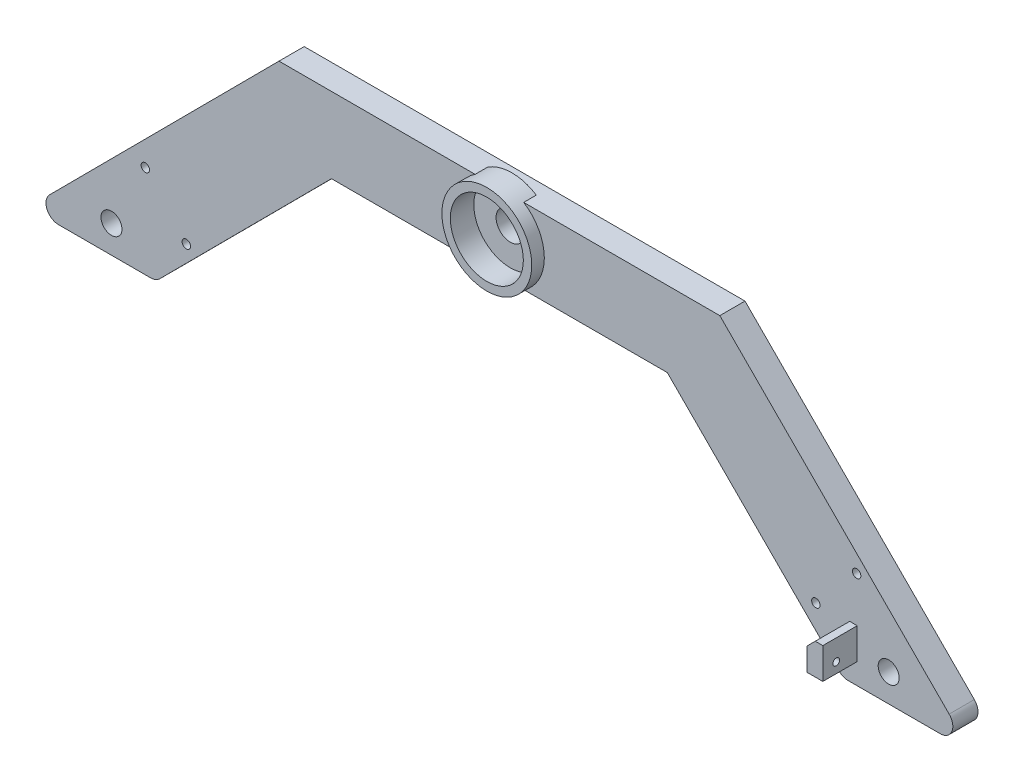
ISO-10303-21;
HEADER;
FILE_DESCRIPTION(('STEP AP214'),'2;1');
FILE_NAME('part.step','',(''),(''),'','','');
FILE_SCHEMA(('AUTOMOTIVE_DESIGN { 1 0 10303 214 1 1 1 1 }'));
ENDSEC;
DATA;
#1=APPLICATION_CONTEXT('core data for automotive mechanical design processes');
#2=APPLICATION_PROTOCOL_DEFINITION('international standard','automotive_design',2000,#1);
#3=PRODUCT_CONTEXT('',#1,'mechanical');
#4=PRODUCT('Part','Part','',(#3));
#5=PRODUCT_RELATED_PRODUCT_CATEGORY('part','',(#4));
#6=PRODUCT_DEFINITION_FORMATION('','',#4);
#7=PRODUCT_DEFINITION_CONTEXT('part definition',#1,'design');
#8=PRODUCT_DEFINITION('design','',#6,#7);
#9=PRODUCT_DEFINITION_SHAPE('','',#8);
#10=(LENGTH_UNIT() NAMED_UNIT(*) SI_UNIT(.MILLI.,.METRE.));
#11=(NAMED_UNIT(*) PLANE_ANGLE_UNIT() SI_UNIT($,.RADIAN.));
#12=(NAMED_UNIT(*) SI_UNIT($,.STERADIAN.) SOLID_ANGLE_UNIT());
#13=UNCERTAINTY_MEASURE_WITH_UNIT(LENGTH_MEASURE(1.E-05),#10,'distance_accuracy_value','');
#14=(GEOMETRIC_REPRESENTATION_CONTEXT(3) GLOBAL_UNCERTAINTY_ASSIGNED_CONTEXT((#13)) GLOBAL_UNIT_ASSIGNED_CONTEXT((#10,
#11,#12)) REPRESENTATION_CONTEXT('',''));
#15=CARTESIAN_POINT('',(0.,0.,0.));
#16=DIRECTION('',(0.,0.,1.));
#17=DIRECTION('',(1.,0.,0.));
#18=AXIS2_PLACEMENT_3D('',#15,#16,#17);
#19=CARTESIAN_POINT('',(-47.8356723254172,-72.890134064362,3.81));
#20=DIRECTION('',(0.,0.,-1.));
#21=DIRECTION('',(-1.,0.,0.));
#22=AXIS2_PLACEMENT_3D('',#19,#20,#21);
#23=PLANE('',#22);
#24=CARTESIAN_POINT('',(153.351887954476,-61.252783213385,3.81));
#25=DIRECTION('',(0.,0.,-1.));
#26=DIRECTION('',(-1.,0.,0.));
#27=AXIS2_PLACEMENT_3D('',#24,#25,#26);
#28=CIRCLE('',#27,1.27);
#29=CARTESIAN_POINT('',(152.081887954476,-61.252783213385,3.81));
#30=VERTEX_POINT('',#29);
#31=EDGE_CURVE('E488',#30,#30,#28,.T.);
#32=ORIENTED_EDGE('',*,*,#31,.T.);
#33=EDGE_LOOP('',(#32));
#34=FACE_BOUND('',#33,.T.);
#35=CARTESIAN_POINT('',(165.69439712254,-47.3692411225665,3.81));
#36=DIRECTION('',(0.,0.,-1.));
#37=DIRECTION('',(-1.,0.,0.));
#38=AXIS2_PLACEMENT_3D('',#35,#36,#37);
#39=CIRCLE('',#38,1.27);
#40=CARTESIAN_POINT('',(164.42439712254,-47.3692411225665,3.81));
#41=VERTEX_POINT('',#40);
#42=EDGE_CURVE('E485',#41,#41,#39,.T.);
#43=ORIENTED_EDGE('',*,*,#42,.T.);
#44=EDGE_LOOP('',(#43));
#45=FACE_BOUND('',#44,.T.);
#46=CARTESIAN_POINT('',(175.383820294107,-68.318134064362,3.81));
#47=DIRECTION('',(0.,0.,1.));
#48=DIRECTION('',(1.,0.,0.));
#49=AXIS2_PLACEMENT_3D('',#46,#47,#48);
#50=CIRCLE('',#49,3.175);
#51=CARTESIAN_POINT('',(178.558820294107,-68.318134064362,3.81));
#52=VERTEX_POINT('',#51);
#53=EDGE_CURVE('E253',#52,#52,#50,.T.);
#54=ORIENTED_EDGE('',*,*,#53,.F.);
#55=EDGE_LOOP('',(#54));
#56=FACE_BOUND('',#55,.T.);
#57=CARTESIAN_POINT('',(57.6277046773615,-11.930134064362,3.81));
#58=DIRECTION('',(0.,0.,-1.));
#59=DIRECTION('',(-1.,0.,0.));
#60=AXIS2_PLACEMENT_3D('',#57,#58,#59);
#61=CIRCLE('',#60,13.589);
#62=CARTESIAN_POINT('',(64.9627208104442,-23.3694723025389,3.81));
#63=VERTEX_POINT('',#62);
#64=CARTESIAN_POINT('',(64.9772639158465,-0.500134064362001,3.81));
#65=VERTEX_POINT('',#64);
#66=EDGE_CURVE('E354',#63,#65,#61,.F.);
#67=ORIENTED_EDGE('',*,*,#66,.F.);
#68=DIRECTION('',(1.,0.,0.));
#69=VECTOR('',#68,1.);
#70=CARTESIAN_POINT('',(6.82770467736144,-23.3694723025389,3.81));
#71=LINE('',#70,#69);
#72=CARTESIAN_POINT('',(108.427704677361,-23.3694723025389,3.81));
#73=VERTEX_POINT('',#72);
#74=EDGE_CURVE('E290',#63,#73,#71,.T.);
#75=ORIENTED_EDGE('',*,*,#74,.T.);
#76=DIRECTION('',(-0.7054389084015,0.708770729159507,0.));
#77=VECTOR('',#76,1.);
#78=CARTESIAN_POINT('',(160.390665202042,-75.5778563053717,3.81));
#79=LINE('',#78,#77);
#80=CARTESIAN_POINT('',(160.390665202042,-75.5778563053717,3.81));
#81=VERTEX_POINT('',#80);
#82=EDGE_CURVE('E287',#81,#73,#79,.T.);
#83=ORIENTED_EDGE('',*,*,#82,.F.);
#84=CARTESIAN_POINT('',(163.09108168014,-72.890134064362,3.81));
#85=DIRECTION('',(0.,0.,1.));
#86=DIRECTION('',(1.,0.,0.));
#87=AXIS2_PLACEMENT_3D('',#84,#85,#86);
#88=CIRCLE('',#87,3.81000000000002);
#89=CARTESIAN_POINT('',(163.09108168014,-76.700134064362,3.81));
#90=VERTEX_POINT('',#89);
#91=EDGE_CURVE('E285',#81,#90,#88,.T.);
#92=ORIENTED_EDGE('',*,*,#91,.T.);
#93=DIRECTION('',(-1.,0.,0.));
#94=VECTOR('',#93,1.);
#95=CARTESIAN_POINT('',(190.977704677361,-76.700134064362,3.81));
#96=LINE('',#95,#94);
#97=CARTESIAN_POINT('',(190.977704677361,-76.700134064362,3.81));
#98=VERTEX_POINT('',#97);
#99=EDGE_CURVE('E282',#98,#90,#96,.T.);
#100=ORIENTED_EDGE('',*,*,#99,.F.);
#101=CARTESIAN_POINT('',(190.977704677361,-72.890134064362,3.81));
#102=DIRECTION('',(0.,0.,1.));
#103=DIRECTION('',(1.,0.,0.));
#104=AXIS2_PLACEMENT_3D('',#101,#102,#103);
#105=CIRCLE('',#104,3.81000000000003);
#106=CARTESIAN_POINT('',(193.678121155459,-70.2024118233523,3.81));
#107=VERTEX_POINT('',#106);
#108=EDGE_CURVE('E280',#98,#107,#105,.T.);
#109=ORIENTED_EDGE('',*,*,#108,.T.);
#110=DIRECTION('',(-0.705438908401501,0.708770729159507,0.));
#111=VECTOR('',#110,1.);
#112=CARTESIAN_POINT('',(193.678121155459,-70.2024118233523,3.81));
#113=LINE('',#112,#111);
#114=CARTESIAN_POINT('',(124.303502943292,-0.500134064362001,3.81));
#115=VERTEX_POINT('',#114);
#116=EDGE_CURVE('E277',#107,#115,#113,.T.);
#117=ORIENTED_EDGE('',*,*,#116,.T.);
#118=DIRECTION('',(1.,0.,0.));
#119=VECTOR('',#118,1.);
#120=CARTESIAN_POINT('',(-9.04809358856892,-0.500134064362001,3.81));
#121=LINE('',#120,#119);
#122=EDGE_CURVE('E273',#65,#115,#121,.T.);
#123=ORIENTED_EDGE('',*,*,#122,.F.);
#124=EDGE_LOOP('',(#67,#75,#83,#92,#100,#109,#117,#123));
#125=FACE_BOUND('',#124,.T.);
#126=DIRECTION('',(0.,-1.,0.));
#127=VECTOR('',#126,1.);
#128=CARTESIAN_POINT('',(161.049297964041,-60.952134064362,3.81));
#129=LINE('',#128,#127);
#130=CARTESIAN_POINT('',(161.049297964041,-63.492134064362,3.81));
#131=VERTEX_POINT('',#130);
#132=CARTESIAN_POINT('',(161.049297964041,-70.350134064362,3.81));
#133=VERTEX_POINT('',#132);
#134=EDGE_CURVE('E208',#131,#133,#129,.T.);
#135=ORIENTED_EDGE('',*,*,#134,.F.);
#136=DIRECTION('',(-0.707106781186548,-0.707106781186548,0.));
#137=VECTOR('',#136,1.);
#138=CARTESIAN_POINT('',(51.9078128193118,-172.633619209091,3.81));
#139=LINE('',#138,#137);
#140=CARTESIAN_POINT('',(163.589297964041,-60.952134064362,3.81));
#141=VERTEX_POINT('',#140);
#142=EDGE_CURVE('E64',#131,#141,#139,.F.);
#143=ORIENTED_EDGE('',*,*,#142,.T.);
#144=DIRECTION('',(-1.,0.,0.));
#145=VECTOR('',#144,1.);
#146=CARTESIAN_POINT('',(161.049297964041,-60.952134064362,3.81));
#147=LINE('',#146,#145);
#148=CARTESIAN_POINT('',(165.875297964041,-60.952134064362,3.81));
#149=VERTEX_POINT('',#148);
#150=EDGE_CURVE('E195',#149,#141,#147,.T.);
#151=ORIENTED_EDGE('',*,*,#150,.F.);
#152=DIRECTION('',(0.,1.,0.));
#153=VECTOR('',#152,1.);
#154=CARTESIAN_POINT('',(165.875297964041,-60.952134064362,3.81));
#155=LINE('',#154,#153);
#156=CARTESIAN_POINT('',(165.875297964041,-70.350134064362,3.81));
#157=VERTEX_POINT('',#156);
#158=EDGE_CURVE('E504',#157,#149,#155,.T.);
#159=ORIENTED_EDGE('',*,*,#158,.F.);
#160=DIRECTION('',(1.,0.,0.));
#161=VECTOR('',#160,1.);
#162=CARTESIAN_POINT('',(161.049297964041,-70.350134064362,3.81));
#163=LINE('',#162,#161);
#164=EDGE_CURVE('E502',#133,#157,#163,.T.);
#165=ORIENTED_EDGE('',*,*,#164,.F.);
#166=EDGE_LOOP('',(#135,#143,#151,#159,#165));
#167=FACE_BOUND('',#166,.T.);
#168=ADVANCED_FACE('F41',(#34,#45,#56,#125,#167),#23,.F.);
#169=CARTESIAN_POINT('',(57.6277046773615,-11.930134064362,-16.0231483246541));
#170=DIRECTION('',(0.,0.,1.));
#171=DIRECTION('',(1.,0.,0.));
#172=AXIS2_PLACEMENT_3D('',#169,#170,#171);
#173=CYLINDRICAL_SURFACE('',#172,4.318);
#174=CARTESIAN_POINT('',(57.6277046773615,-11.930134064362,-3.81));
#175=DIRECTION('',(0.,0.,-1.));
#176=DIRECTION('',(-1.,0.,0.));
#177=AXIS2_PLACEMENT_3D('',#174,#175,#176);
#178=CIRCLE('',#177,4.318);
#179=CARTESIAN_POINT('',(53.3097046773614,-11.930134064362,-3.81));
#180=VERTEX_POINT('',#179);
#181=EDGE_CURVE('E222',#180,#180,#178,.F.);
#182=ORIENTED_EDGE('',*,*,#181,.F.);
#183=EDGE_LOOP('',(#182));
#184=FACE_BOUND('',#183,.T.);
#185=CARTESIAN_POINT('',(57.6277046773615,-11.930134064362,0.507999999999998));
#186=DIRECTION('',(0.,0.,1.));
#187=DIRECTION('',(1.,0.,0.));
#188=AXIS2_PLACEMENT_3D('',#185,#186,#187);
#189=CIRCLE('',#188,4.318);
#190=CARTESIAN_POINT('',(61.9457046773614,-11.930134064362,0.507999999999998));
#191=VERTEX_POINT('',#190);
#192=EDGE_CURVE('E220',#191,#191,#189,.F.);
#193=ORIENTED_EDGE('',*,*,#192,.F.);
#194=EDGE_LOOP('',(#193));
#195=FACE_BOUND('',#194,.T.);
#196=ADVANCED_FACE('F383',(#184,#195),#173,.F.);
#197=CARTESIAN_POINT('',(6.82770467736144,-23.3694723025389,3.81));
#198=DIRECTION('',(0.,1.,0.));
#199=DIRECTION('',(0.,0.,1.));
#200=AXIS2_PLACEMENT_3D('',#197,#198,#199);
#201=PLANE('',#200);
#202=DIRECTION('',(0.,0.,-1.));
#203=VECTOR('',#202,1.);
#204=CARTESIAN_POINT('',(64.9627208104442,-23.3694723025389,7.62));
#205=LINE('',#204,#203);
#206=CARTESIAN_POINT('',(64.9627208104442,-23.3694723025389,0.));
#207=VERTEX_POINT('',#206);
#208=EDGE_CURVE('E239',#207,#63,#205,.F.);
#209=ORIENTED_EDGE('',*,*,#208,.F.);
#210=DIRECTION('',(1.,0.,0.));
#211=VECTOR('',#210,1.);
#212=CARTESIAN_POINT('',(6.82770467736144,-23.3694723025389,0.));
#213=LINE('',#212,#211);
#214=CARTESIAN_POINT('',(50.2926885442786,-23.3694723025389,0.));
#215=VERTEX_POINT('',#214);
#216=EDGE_CURVE('E242',#215,#207,#213,.T.);
#217=ORIENTED_EDGE('',*,*,#216,.F.);
#218=DIRECTION('',(0.,0.,-1.));
#219=VECTOR('',#218,1.);
#220=CARTESIAN_POINT('',(50.2926885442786,-23.3694723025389,7.62));
#221=LINE('',#220,#219);
#222=CARTESIAN_POINT('',(50.2926885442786,-23.3694723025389,3.81));
#223=VERTEX_POINT('',#222);
#224=EDGE_CURVE('E234',#223,#215,#221,.T.);
#225=ORIENTED_EDGE('',*,*,#224,.F.);
#226=CARTESIAN_POINT('',(6.82770467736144,-23.3694723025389,3.81));
#227=VERTEX_POINT('',#226);
#228=EDGE_CURVE('E291',#227,#223,#71,.T.);
#229=ORIENTED_EDGE('',*,*,#228,.F.);
#230=DIRECTION('',(0.,0.,-1.));
#231=VECTOR('',#230,1.);
#232=CARTESIAN_POINT('',(6.82770467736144,-23.3694723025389,3.81));
#233=LINE('',#232,#231);
#234=CARTESIAN_POINT('',(6.82770467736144,-23.3694723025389,-3.81));
#235=VERTEX_POINT('',#234);
#236=EDGE_CURVE('E327',#227,#235,#233,.T.);
#237=ORIENTED_EDGE('',*,*,#236,.T.);
#238=DIRECTION('',(1.,0.,0.));
#239=VECTOR('',#238,1.);
#240=CARTESIAN_POINT('',(6.82770467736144,-23.3694723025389,-3.81));
#241=LINE('',#240,#239);
#242=CARTESIAN_POINT('',(108.427704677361,-23.3694723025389,-3.81));
#243=VERTEX_POINT('',#242);
#244=EDGE_CURVE('E262',#235,#243,#241,.T.);
#245=ORIENTED_EDGE('',*,*,#244,.T.);
#246=DIRECTION('',(0.,0.,-1.));
#247=VECTOR('',#246,1.);
#248=CARTESIAN_POINT('',(108.427704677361,-23.3694723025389,3.81));
#249=LINE('',#248,#247);
#250=EDGE_CURVE('E330',#73,#243,#249,.T.);
#251=ORIENTED_EDGE('',*,*,#250,.F.);
#252=ORIENTED_EDGE('',*,*,#74,.F.);
#253=EDGE_LOOP('',(#209,#217,#225,#229,#237,#245,#251,#252));
#254=FACE_BOUND('',#253,.T.);
#255=ADVANCED_FACE('F391',(#254),#201,.F.);
#256=CARTESIAN_POINT('',(-9.04809358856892,-0.500134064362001,3.81));
#257=DIRECTION('',(0.,1.,0.));
#258=DIRECTION('',(0.,0.,1.));
#259=AXIS2_PLACEMENT_3D('',#256,#257,#258);
#260=PLANE('',#259);
#261=DIRECTION('',(1.,0.,0.));
#262=VECTOR('',#261,1.);
#263=CARTESIAN_POINT('',(-9.04809358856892,-0.500134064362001,0.));
#264=LINE('',#263,#262);
#265=CARTESIAN_POINT('',(50.2781454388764,-0.500134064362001,0.));
#266=VERTEX_POINT('',#265);
#267=CARTESIAN_POINT('',(64.9772639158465,-0.500134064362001,0.));
#268=VERTEX_POINT('',#267);
#269=EDGE_CURVE('E355',#266,#268,#264,.T.);
#270=ORIENTED_EDGE('',*,*,#269,.T.);
#271=DIRECTION('',(0.,0.,-1.));
#272=VECTOR('',#271,1.);
#273=CARTESIAN_POINT('',(64.9772639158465,-0.500134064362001,7.62));
#274=LINE('',#273,#272);
#275=EDGE_CURVE('E237',#268,#65,#274,.F.);
#276=ORIENTED_EDGE('',*,*,#275,.T.);
#277=ORIENTED_EDGE('',*,*,#122,.T.);
#278=DIRECTION('',(0.,0.,-1.));
#279=VECTOR('',#278,1.);
#280=CARTESIAN_POINT('',(124.303502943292,-0.500134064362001,3.81));
#281=LINE('',#280,#279);
#282=CARTESIAN_POINT('',(124.303502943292,-0.500134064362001,-3.81));
#283=VERTEX_POINT('',#282);
#284=EDGE_CURVE('E341',#115,#283,#281,.T.);
#285=ORIENTED_EDGE('',*,*,#284,.T.);
#286=DIRECTION('',(1.,0.,0.));
#287=VECTOR('',#286,1.);
#288=CARTESIAN_POINT('',(-9.04809358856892,-0.500134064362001,-3.81));
#289=LINE('',#288,#287);
#290=CARTESIAN_POINT('',(-9.04809358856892,-0.500134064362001,-3.81));
#291=VERTEX_POINT('',#290);
#292=EDGE_CURVE('E308',#291,#283,#289,.T.);
#293=ORIENTED_EDGE('',*,*,#292,.F.);
#294=DIRECTION('',(0.,0.,-1.));
#295=VECTOR('',#294,1.);
#296=CARTESIAN_POINT('',(-9.04809358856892,-0.500134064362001,3.81));
#297=LINE('',#296,#295);
#298=CARTESIAN_POINT('',(-9.04809358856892,-0.500134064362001,3.81));
#299=VERTEX_POINT('',#298);
#300=EDGE_CURVE('E343',#299,#291,#297,.T.);
#301=ORIENTED_EDGE('',*,*,#300,.F.);
#302=CARTESIAN_POINT('',(50.2781454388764,-0.500134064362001,3.81));
#303=VERTEX_POINT('',#302);
#304=EDGE_CURVE('E274',#299,#303,#121,.T.);
#305=ORIENTED_EDGE('',*,*,#304,.T.);
#306=DIRECTION('',(0.,0.,-1.));
#307=VECTOR('',#306,1.);
#308=CARTESIAN_POINT('',(50.2781454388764,-0.500134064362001,7.62));
#309=LINE('',#308,#307);
#310=EDGE_CURVE('E229',#303,#266,#309,.T.);
#311=ORIENTED_EDGE('',*,*,#310,.T.);
#312=EDGE_LOOP('',(#270,#276,#277,#285,#293,#301,#305,#311));
#313=FACE_BOUND('',#312,.T.);
#314=ADVANCED_FACE('F521',(#313),#260,.T.);
#315=CARTESIAN_POINT('',(6.82770467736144,-23.3694723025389,3.81));
#316=DIRECTION('',(0.708770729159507,-0.7054389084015,0.));
#317=DIRECTION('',(0.7054389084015,0.708770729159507,0.));
#318=AXIS2_PLACEMENT_3D('',#315,#316,#317);
#319=PLANE('',#318);
#320=DIRECTION('',(-0.7054389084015,-0.708770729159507,0.));
#321=VECTOR('',#320,1.);
#322=CARTESIAN_POINT('',(6.82770467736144,-23.3694723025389,-3.81));
#323=LINE('',#322,#321);
#324=CARTESIAN_POINT('',(-45.1352558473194,-75.5778563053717,-3.81));
#325=VERTEX_POINT('',#324);
#326=EDGE_CURVE('E249',#235,#325,#323,.T.);
#327=ORIENTED_EDGE('',*,*,#326,.F.);
#328=ORIENTED_EDGE('',*,*,#236,.F.);
#329=DIRECTION('',(-0.7054389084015,-0.708770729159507,0.));
#330=VECTOR('',#329,1.);
#331=CARTESIAN_POINT('',(6.82770467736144,-23.3694723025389,3.81));
#332=LINE('',#331,#330);
#333=CARTESIAN_POINT('',(-45.1352558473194,-75.5778563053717,3.81));
#334=VERTEX_POINT('',#333);
#335=EDGE_CURVE('E258',#227,#334,#332,.T.);
#336=ORIENTED_EDGE('',*,*,#335,.T.);
#337=DIRECTION('',(0.,0.,-1.));
#338=VECTOR('',#337,1.);
#339=CARTESIAN_POINT('',(-45.1352558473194,-75.5778563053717,3.81));
#340=LINE('',#339,#338);
#341=EDGE_CURVE('E293',#334,#325,#340,.T.);
#342=ORIENTED_EDGE('',*,*,#341,.T.);
#343=EDGE_LOOP('',(#327,#328,#336,#342));
#344=FACE_BOUND('',#343,.T.);
#345=ADVANCED_FACE('F518',(#344),#319,.T.);
#346=CARTESIAN_POINT('',(160.390665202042,-75.5778563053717,3.81));
#347=DIRECTION('',(-0.708770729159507,-0.7054389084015,0.));
#348=DIRECTION('',(0.7054389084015,-0.708770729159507,0.));
#349=AXIS2_PLACEMENT_3D('',#346,#347,#348);
#350=PLANE('',#349);
#351=DIRECTION('',(-0.7054389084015,0.708770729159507,0.));
#352=VECTOR('',#351,1.);
#353=CARTESIAN_POINT('',(160.390665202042,-75.5778563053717,-3.81));
#354=LINE('',#353,#352);
#355=CARTESIAN_POINT('',(160.390665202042,-75.5778563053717,-3.81));
#356=VERTEX_POINT('',#355);
#357=EDGE_CURVE('E322',#356,#243,#354,.T.);
#358=ORIENTED_EDGE('',*,*,#357,.F.);
#359=DIRECTION('',(0.,0.,-1.));
#360=VECTOR('',#359,1.);
#361=CARTESIAN_POINT('',(160.390665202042,-75.5778563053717,3.81));
#362=LINE('',#361,#360);
#363=EDGE_CURVE('E332',#81,#356,#362,.T.);
#364=ORIENTED_EDGE('',*,*,#363,.F.);
#365=ORIENTED_EDGE('',*,*,#82,.T.);
#366=ORIENTED_EDGE('',*,*,#250,.T.);
#367=EDGE_LOOP('',(#358,#364,#365,#366));
#368=FACE_BOUND('',#367,.T.);
#369=ADVANCED_FACE('F520',(#368),#350,.T.);
#370=CARTESIAN_POINT('',(163.09108168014,-72.890134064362,3.81));
#371=DIRECTION('',(0.,0.,-1.));
#372=DIRECTION('',(-1.,0.,0.));
#373=AXIS2_PLACEMENT_3D('',#370,#371,#372);
#374=CYLINDRICAL_SURFACE('',#373,3.81000000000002);
#375=CARTESIAN_POINT('',(163.09108168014,-72.890134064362,-3.81));
#376=DIRECTION('',(0.,0.,1.));
#377=DIRECTION('',(1.,0.,0.));
#378=AXIS2_PLACEMENT_3D('',#375,#376,#377);
#379=CIRCLE('',#378,3.81000000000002);
#380=CARTESIAN_POINT('',(163.09108168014,-76.700134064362,-3.81));
#381=VERTEX_POINT('',#380);
#382=EDGE_CURVE('E319',#356,#381,#379,.T.);
#383=ORIENTED_EDGE('',*,*,#382,.T.);
#384=DIRECTION('',(0.,0.,-1.));
#385=VECTOR('',#384,1.);
#386=CARTESIAN_POINT('',(163.09108168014,-76.700134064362,3.81));
#387=LINE('',#386,#385);
#388=EDGE_CURVE('E334',#90,#381,#387,.T.);
#389=ORIENTED_EDGE('',*,*,#388,.F.);
#390=ORIENTED_EDGE('',*,*,#91,.F.);
#391=ORIENTED_EDGE('',*,*,#363,.T.);
#392=EDGE_LOOP('',(#383,#389,#390,#391));
#393=FACE_BOUND('',#392,.T.);
#394=ADVANCED_FACE('F549',(#393),#374,.T.);
#395=CARTESIAN_POINT('',(190.977704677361,-76.700134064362,3.81));
#396=DIRECTION('',(0.,-1.,0.));
#397=DIRECTION('',(1.,0.,0.));
#398=AXIS2_PLACEMENT_3D('',#395,#396,#397);
#399=PLANE('',#398);
#400=DIRECTION('',(-1.,0.,0.));
#401=VECTOR('',#400,1.);
#402=CARTESIAN_POINT('',(190.977704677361,-76.700134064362,-3.81));
#403=LINE('',#402,#401);
#404=CARTESIAN_POINT('',(190.977704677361,-76.700134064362,-3.81));
#405=VERTEX_POINT('',#404);
#406=EDGE_CURVE('E316',#405,#381,#403,.T.);
#407=ORIENTED_EDGE('',*,*,#406,.F.);
#408=DIRECTION('',(0.,0.,-1.));
#409=VECTOR('',#408,1.);
#410=CARTESIAN_POINT('',(190.977704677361,-76.700134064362,3.81));
#411=LINE('',#410,#409);
#412=EDGE_CURVE('E336',#98,#405,#411,.T.);
#413=ORIENTED_EDGE('',*,*,#412,.F.);
#414=ORIENTED_EDGE('',*,*,#99,.T.);
#415=ORIENTED_EDGE('',*,*,#388,.T.);
#416=EDGE_LOOP('',(#407,#413,#414,#415));
#417=FACE_BOUND('',#416,.T.);
#418=ADVANCED_FACE('F545',(#417),#399,.T.);
#419=CARTESIAN_POINT('',(190.977704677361,-72.890134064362,3.81));
#420=DIRECTION('',(0.,0.,-1.));
#421=DIRECTION('',(-1.,0.,0.));
#422=AXIS2_PLACEMENT_3D('',#419,#420,#421);
#423=CYLINDRICAL_SURFACE('',#422,3.81000000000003);
#424=CARTESIAN_POINT('',(190.977704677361,-72.890134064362,-3.81));
#425=DIRECTION('',(0.,0.,1.));
#426=DIRECTION('',(1.,0.,0.));
#427=AXIS2_PLACEMENT_3D('',#424,#425,#426);
#428=CIRCLE('',#427,3.81000000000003);
#429=CARTESIAN_POINT('',(193.678121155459,-70.2024118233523,-3.81));
#430=VERTEX_POINT('',#429);
#431=EDGE_CURVE('E314',#405,#430,#428,.T.);
#432=ORIENTED_EDGE('',*,*,#431,.T.);
#433=DIRECTION('',(0.,0.,-1.));
#434=VECTOR('',#433,1.);
#435=CARTESIAN_POINT('',(193.678121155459,-70.2024118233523,3.81));
#436=LINE('',#435,#434);
#437=EDGE_CURVE('E338',#107,#430,#436,.T.);
#438=ORIENTED_EDGE('',*,*,#437,.F.);
#439=ORIENTED_EDGE('',*,*,#108,.F.);
#440=ORIENTED_EDGE('',*,*,#412,.T.);
#441=EDGE_LOOP('',(#432,#438,#439,#440));
#442=FACE_BOUND('',#441,.T.);
#443=ADVANCED_FACE('F541',(#442),#423,.T.);
#444=CARTESIAN_POINT('',(193.678121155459,-70.2024118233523,3.81));
#445=DIRECTION('',(-0.708770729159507,-0.7054389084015,0.));
#446=DIRECTION('',(0.7054389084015,-0.708770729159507,0.));
#447=AXIS2_PLACEMENT_3D('',#444,#445,#446);
#448=PLANE('',#447);
#449=DIRECTION('',(-0.705438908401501,0.708770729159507,0.));
#450=VECTOR('',#449,1.);
#451=CARTESIAN_POINT('',(193.678121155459,-70.2024118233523,-3.81));
#452=LINE('',#451,#450);
#453=EDGE_CURVE('E311',#430,#283,#452,.T.);
#454=ORIENTED_EDGE('',*,*,#453,.T.);
#455=ORIENTED_EDGE('',*,*,#284,.F.);
#456=ORIENTED_EDGE('',*,*,#116,.F.);
#457=ORIENTED_EDGE('',*,*,#437,.T.);
#458=EDGE_LOOP('',(#454,#455,#456,#457));
#459=FACE_BOUND('',#458,.T.);
#460=ADVANCED_FACE('F534',(#459),#448,.F.);
#461=CARTESIAN_POINT('',(-78.4227118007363,-70.2024118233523,3.81));
#462=DIRECTION('',(-0.708770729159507,0.7054389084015,0.));
#463=DIRECTION('',(-0.7054389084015,-0.708770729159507,0.));
#464=AXIS2_PLACEMENT_3D('',#461,#462,#463);
#465=PLANE('',#464);
#466=DIRECTION('',(0.7054389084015,0.708770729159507,0.));
#467=VECTOR('',#466,1.);
#468=CARTESIAN_POINT('',(-78.4227118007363,-70.2024118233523,-3.81));
#469=LINE('',#468,#467);
#470=CARTESIAN_POINT('',(-78.4227118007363,-70.2024118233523,-3.81));
#471=VERTEX_POINT('',#470);
#472=EDGE_CURVE('E305',#471,#291,#469,.T.);
#473=ORIENTED_EDGE('',*,*,#472,.F.);
#474=DIRECTION('',(0.,0.,-1.));
#475=VECTOR('',#474,1.);
#476=CARTESIAN_POINT('',(-78.4227118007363,-70.2024118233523,3.81));
#477=LINE('',#476,#475);
#478=CARTESIAN_POINT('',(-78.4227118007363,-70.2024118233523,3.81));
#479=VERTEX_POINT('',#478);
#480=EDGE_CURVE('E345',#479,#471,#477,.T.);
#481=ORIENTED_EDGE('',*,*,#480,.F.);
#482=DIRECTION('',(0.7054389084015,0.708770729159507,0.));
#483=VECTOR('',#482,1.);
#484=CARTESIAN_POINT('',(-78.4227118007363,-70.2024118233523,3.81));
#485=LINE('',#484,#483);
#486=EDGE_CURVE('E270',#479,#299,#485,.T.);
#487=ORIENTED_EDGE('',*,*,#486,.T.);
#488=ORIENTED_EDGE('',*,*,#300,.T.);
#489=EDGE_LOOP('',(#473,#481,#487,#488));
#490=FACE_BOUND('',#489,.T.);
#491=ADVANCED_FACE('F530',(#490),#465,.T.);
#492=CARTESIAN_POINT('',(-75.7222953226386,-72.890134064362,3.81));
#493=DIRECTION('',(0.,0.,-1.));
#494=DIRECTION('',(-1.,0.,0.));
#495=AXIS2_PLACEMENT_3D('',#492,#493,#494);
#496=CYLINDRICAL_SURFACE('',#495,3.80999999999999);
#497=CARTESIAN_POINT('',(-75.7222953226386,-72.890134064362,-3.81));
#498=DIRECTION('',(0.,0.,-1.));
#499=DIRECTION('',(-1.,0.,0.));
#500=AXIS2_PLACEMENT_3D('',#497,#498,#499);
#501=CIRCLE('',#500,3.80999999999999);
#502=CARTESIAN_POINT('',(-75.7222953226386,-76.700134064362,-3.81));
#503=VERTEX_POINT('',#502);
#504=EDGE_CURVE('E302',#503,#471,#501,.T.);
#505=ORIENTED_EDGE('',*,*,#504,.F.);
#506=DIRECTION('',(0.,0.,-1.));
#507=VECTOR('',#506,1.);
#508=CARTESIAN_POINT('',(-75.7222953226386,-76.700134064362,3.81));
#509=LINE('',#508,#507);
#510=CARTESIAN_POINT('',(-75.7222953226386,-76.700134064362,3.81));
#511=VERTEX_POINT('',#510);
#512=EDGE_CURVE('E347',#511,#503,#509,.T.);
#513=ORIENTED_EDGE('',*,*,#512,.F.);
#514=CARTESIAN_POINT('',(-75.7222953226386,-72.890134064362,3.81));
#515=DIRECTION('',(0.,0.,-1.));
#516=DIRECTION('',(-1.,0.,0.));
#517=AXIS2_PLACEMENT_3D('',#514,#515,#516);
#518=CIRCLE('',#517,3.80999999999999);
#519=EDGE_CURVE('E267',#511,#479,#518,.T.);
#520=ORIENTED_EDGE('',*,*,#519,.T.);
#521=ORIENTED_EDGE('',*,*,#480,.T.);
#522=EDGE_LOOP('',(#505,#513,#520,#521));
#523=FACE_BOUND('',#522,.T.);
#524=ADVANCED_FACE('F526',(#523),#496,.T.);
#525=CARTESIAN_POINT('',(-75.7222953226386,-76.700134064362,3.81));
#526=DIRECTION('',(0.,1.,0.));
#527=DIRECTION('',(-1.,0.,0.));
#528=AXIS2_PLACEMENT_3D('',#525,#526,#527);
#529=PLANE('',#528);
#530=DIRECTION('',(1.,0.,0.));
#531=VECTOR('',#530,1.);
#532=CARTESIAN_POINT('',(-75.7222953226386,-76.700134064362,-3.81));
#533=LINE('',#532,#531);
#534=CARTESIAN_POINT('',(-47.8356723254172,-76.700134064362,-3.81));
#535=VERTEX_POINT('',#534);
#536=EDGE_CURVE('E299',#503,#535,#533,.T.);
#537=ORIENTED_EDGE('',*,*,#536,.T.);
#538=DIRECTION('',(0.,0.,-1.));
#539=VECTOR('',#538,1.);
#540=CARTESIAN_POINT('',(-47.8356723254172,-76.700134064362,3.81));
#541=LINE('',#540,#539);
#542=CARTESIAN_POINT('',(-47.8356723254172,-76.700134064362,3.81));
#543=VERTEX_POINT('',#542);
#544=EDGE_CURVE('E349',#543,#535,#541,.T.);
#545=ORIENTED_EDGE('',*,*,#544,.F.);
#546=DIRECTION('',(1.,0.,0.));
#547=VECTOR('',#546,1.);
#548=CARTESIAN_POINT('',(-75.7222953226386,-76.700134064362,3.81));
#549=LINE('',#548,#547);
#550=EDGE_CURVE('E265',#511,#543,#549,.T.);
#551=ORIENTED_EDGE('',*,*,#550,.F.);
#552=ORIENTED_EDGE('',*,*,#512,.T.);
#553=EDGE_LOOP('',(#537,#545,#551,#552));
#554=FACE_BOUND('',#553,.T.);
#555=ADVANCED_FACE('F407',(#554),#529,.F.);
#556=CARTESIAN_POINT('',(-47.8356723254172,-72.890134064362,3.81));
#557=DIRECTION('',(0.,0.,-1.));
#558=DIRECTION('',(-1.,0.,0.));
#559=AXIS2_PLACEMENT_3D('',#556,#557,#558);
#560=CYLINDRICAL_SURFACE('',#559,3.81000000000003);
#561=CARTESIAN_POINT('',(-47.8356723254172,-72.890134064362,-3.81));
#562=DIRECTION('',(0.,0.,-1.));
#563=DIRECTION('',(-1.,0.,0.));
#564=AXIS2_PLACEMENT_3D('',#561,#562,#563);
#565=CIRCLE('',#564,3.81000000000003);
#566=EDGE_CURVE('E296',#325,#535,#565,.T.);
#567=ORIENTED_EDGE('',*,*,#566,.F.);
#568=ORIENTED_EDGE('',*,*,#341,.F.);
#569=CARTESIAN_POINT('',(-47.8356723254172,-72.890134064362,3.81));
#570=DIRECTION('',(0.,0.,-1.));
#571=DIRECTION('',(-1.,0.,0.));
#572=AXIS2_PLACEMENT_3D('',#569,#570,#571);
#573=CIRCLE('',#572,3.81000000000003);
#574=EDGE_CURVE('E261',#334,#543,#573,.T.);
#575=ORIENTED_EDGE('',*,*,#574,.T.);
#576=ORIENTED_EDGE('',*,*,#544,.T.);
#577=EDGE_LOOP('',(#567,#568,#575,#576));
#578=FACE_BOUND('',#577,.T.);
#579=ADVANCED_FACE('F399',(#578),#560,.T.);
#580=CARTESIAN_POINT('',(-49.4869231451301,-48.6163737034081,3.81));
#581=DIRECTION('',(0.,0.,-1.));
#582=DIRECTION('',(-1.,0.,0.));
#583=AXIS2_PLACEMENT_3D('',#580,#581,#582);
#584=CIRCLE('',#583,1.27);
#585=CARTESIAN_POINT('',(-50.7569231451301,-48.6163737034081,3.81));
#586=VERTEX_POINT('',#585);
#587=EDGE_CURVE('E413',#586,#586,#584,.T.);
#588=ORIENTED_EDGE('',*,*,#587,.T.);
#589=EDGE_LOOP('',(#588));
#590=FACE_BOUND('',#589,.T.);
#591=CARTESIAN_POINT('',(-37.0773609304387,-62.4325460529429,3.81));
#592=DIRECTION('',(0.,0.,-1.));
#593=DIRECTION('',(-1.,0.,0.));
#594=AXIS2_PLACEMENT_3D('',#591,#592,#593);
#595=CIRCLE('',#594,1.27);
#596=CARTESIAN_POINT('',(-38.3473609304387,-62.4325460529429,3.81));
#597=VERTEX_POINT('',#596);
#598=EDGE_CURVE('E417',#597,#597,#595,.T.);
#599=ORIENTED_EDGE('',*,*,#598,.T.);
#600=EDGE_LOOP('',(#599));
#601=FACE_BOUND('',#600,.T.);
#602=EDGE_CURVE('E329',#303,#223,#61,.F.);
#603=ORIENTED_EDGE('',*,*,#602,.F.);
#604=ORIENTED_EDGE('',*,*,#304,.F.);
#605=ORIENTED_EDGE('',*,*,#486,.F.);
#606=ORIENTED_EDGE('',*,*,#519,.F.);
#607=ORIENTED_EDGE('',*,*,#550,.T.);
#608=ORIENTED_EDGE('',*,*,#574,.F.);
#609=ORIENTED_EDGE('',*,*,#335,.F.);
#610=ORIENTED_EDGE('',*,*,#228,.T.);
#611=EDGE_LOOP('',(#603,#604,#605,#606,#607,#608,#609,#610));
#612=FACE_BOUND('',#611,.T.);
#613=CARTESIAN_POINT('',(-59.7202953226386,-68.318134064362,3.81));
#614=DIRECTION('',(0.,0.,1.));
#615=DIRECTION('',(1.,0.,0.));
#616=AXIS2_PLACEMENT_3D('',#613,#614,#615);
#617=CIRCLE('',#616,3.175);
#618=CARTESIAN_POINT('',(-56.5452953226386,-68.318134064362,3.81));
#619=VERTEX_POINT('',#618);
#620=EDGE_CURVE('E250',#619,#619,#617,.T.);
#621=ORIENTED_EDGE('',*,*,#620,.F.);
#622=EDGE_LOOP('',(#621));
#623=FACE_BOUND('',#622,.T.);
#624=ADVANCED_FACE('F386',(#590,#601,#612,#623),#23,.F.);
#625=CARTESIAN_POINT('',(-47.8356723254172,-72.890134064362,-3.81));
#626=DIRECTION('',(0.,0.,-1.));
#627=DIRECTION('',(-1.,0.,0.));
#628=AXIS2_PLACEMENT_3D('',#625,#626,#627);
#629=PLANE('',#628);
#630=CARTESIAN_POINT('',(153.351887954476,-61.252783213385,-3.81));
#631=DIRECTION('',(0.,0.,-1.));
#632=DIRECTION('',(-1.,0.,0.));
#633=AXIS2_PLACEMENT_3D('',#630,#631,#632);
#634=CIRCLE('',#633,1.27);
#635=CARTESIAN_POINT('',(152.081887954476,-61.252783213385,-3.81));
#636=VERTEX_POINT('',#635);
#637=EDGE_CURVE('E809',#636,#636,#634,.T.);
#638=ORIENTED_EDGE('',*,*,#637,.F.);
#639=EDGE_LOOP('',(#638));
#640=FACE_BOUND('',#639,.T.);
#641=CARTESIAN_POINT('',(165.69439712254,-47.3692411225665,-3.81));
#642=DIRECTION('',(0.,0.,-1.));
#643=DIRECTION('',(-1.,0.,0.));
#644=AXIS2_PLACEMENT_3D('',#641,#642,#643);
#645=CIRCLE('',#644,1.27);
#646=CARTESIAN_POINT('',(164.42439712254,-47.3692411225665,-3.81));
#647=VERTEX_POINT('',#646);
#648=EDGE_CURVE('E812',#647,#647,#645,.T.);
#649=ORIENTED_EDGE('',*,*,#648,.F.);
#650=EDGE_LOOP('',(#649));
#651=FACE_BOUND('',#650,.T.);
#652=CARTESIAN_POINT('',(-49.4869231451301,-48.6163737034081,-3.81));
#653=DIRECTION('',(0.,0.,-1.));
#654=DIRECTION('',(-1.,0.,0.));
#655=AXIS2_PLACEMENT_3D('',#652,#653,#654);
#656=CIRCLE('',#655,1.27);
#657=CARTESIAN_POINT('',(-50.7569231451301,-48.6163737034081,-3.81));
#658=VERTEX_POINT('',#657);
#659=EDGE_CURVE('E484',#658,#658,#656,.T.);
#660=ORIENTED_EDGE('',*,*,#659,.F.);
#661=EDGE_LOOP('',(#660));
#662=FACE_BOUND('',#661,.T.);
#663=CARTESIAN_POINT('',(-37.0773609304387,-62.4325460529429,-3.81));
#664=DIRECTION('',(0.,0.,-1.));
#665=DIRECTION('',(-1.,0.,0.));
#666=AXIS2_PLACEMENT_3D('',#663,#664,#665);
#667=CIRCLE('',#666,1.27);
#668=CARTESIAN_POINT('',(-38.3473609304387,-62.4325460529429,-3.81));
#669=VERTEX_POINT('',#668);
#670=EDGE_CURVE('E490',#669,#669,#667,.T.);
#671=ORIENTED_EDGE('',*,*,#670,.F.);
#672=EDGE_LOOP('',(#671));
#673=FACE_BOUND('',#672,.T.);
#674=ORIENTED_EDGE('',*,*,#181,.T.);
#675=EDGE_LOOP('',(#674));
#676=FACE_BOUND('',#675,.T.);
#677=CARTESIAN_POINT('',(-59.7202953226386,-68.318134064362,-3.81));
#678=DIRECTION('',(0.,0.,1.));
#679=DIRECTION('',(1.,0.,0.));
#680=AXIS2_PLACEMENT_3D('',#677,#678,#679);
#681=CIRCLE('',#680,3.175);
#682=CARTESIAN_POINT('',(-56.5452953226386,-68.318134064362,-3.81));
#683=VERTEX_POINT('',#682);
#684=EDGE_CURVE('E246',#683,#683,#681,.T.);
#685=ORIENTED_EDGE('',*,*,#684,.T.);
#686=EDGE_LOOP('',(#685));
#687=FACE_BOUND('',#686,.T.);
#688=CARTESIAN_POINT('',(175.383820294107,-68.318134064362,-3.81));
#689=DIRECTION('',(0.,0.,1.));
#690=DIRECTION('',(1.,0.,0.));
#691=AXIS2_PLACEMENT_3D('',#688,#689,#690);
#692=CIRCLE('',#691,3.175);
#693=CARTESIAN_POINT('',(178.558820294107,-68.318134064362,-3.81));
#694=VERTEX_POINT('',#693);
#695=EDGE_CURVE('E245',#694,#694,#692,.T.);
#696=ORIENTED_EDGE('',*,*,#695,.T.);
#697=EDGE_LOOP('',(#696));
#698=FACE_BOUND('',#697,.T.);
#699=ORIENTED_EDGE('',*,*,#326,.T.);
#700=ORIENTED_EDGE('',*,*,#566,.T.);
#701=ORIENTED_EDGE('',*,*,#536,.F.);
#702=ORIENTED_EDGE('',*,*,#504,.T.);
#703=ORIENTED_EDGE('',*,*,#472,.T.);
#704=ORIENTED_EDGE('',*,*,#292,.T.);
#705=ORIENTED_EDGE('',*,*,#453,.F.);
#706=ORIENTED_EDGE('',*,*,#431,.F.);
#707=ORIENTED_EDGE('',*,*,#406,.T.);
#708=ORIENTED_EDGE('',*,*,#382,.F.);
#709=ORIENTED_EDGE('',*,*,#357,.T.);
#710=ORIENTED_EDGE('',*,*,#244,.F.);
#711=EDGE_LOOP('',(#699,#700,#701,#702,#703,#704,#705,#706,#707,#708,#709,#710));
#712=FACE_BOUND('',#711,.T.);
#713=ADVANCED_FACE('F398',(#640,#651,#662,#673,#676,#687,#698,#712),#629,.T.);
#714=CARTESIAN_POINT('',(175.383820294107,-68.318134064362,-3.81));
#715=DIRECTION('',(0.,0.,1.));
#716=DIRECTION('',(1.,0.,0.));
#717=AXIS2_PLACEMENT_3D('',#714,#715,#716);
#718=CYLINDRICAL_SURFACE('',#717,3.175);
#719=ORIENTED_EDGE('',*,*,#695,.F.);
#720=EDGE_LOOP('',(#719));
#721=FACE_BOUND('',#720,.T.);
#722=ORIENTED_EDGE('',*,*,#53,.T.);
#723=EDGE_LOOP('',(#722));
#724=FACE_BOUND('',#723,.T.);
#725=ADVANCED_FACE('F404',(#721,#724),#718,.F.);
#726=CARTESIAN_POINT('',(-59.7202953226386,-68.318134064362,-3.81));
#727=DIRECTION('',(0.,0.,1.));
#728=DIRECTION('',(1.,0.,0.));
#729=AXIS2_PLACEMENT_3D('',#726,#727,#728);
#730=CYLINDRICAL_SURFACE('',#729,3.175);
#731=ORIENTED_EDGE('',*,*,#684,.F.);
#732=EDGE_LOOP('',(#731));
#733=FACE_BOUND('',#732,.T.);
#734=ORIENTED_EDGE('',*,*,#620,.T.);
#735=EDGE_LOOP('',(#734));
#736=FACE_BOUND('',#735,.T.);
#737=ADVANCED_FACE('F422',(#733,#736),#730,.F.);
#738=CARTESIAN_POINT('',(57.6277046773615,-11.930134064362,0.));
#739=DIRECTION('',(0.,0.,1.));
#740=DIRECTION('',(1.,0.,0.));
#741=AXIS2_PLACEMENT_3D('',#738,#739,#740);
#742=PLANE('',#741);
#743=CARTESIAN_POINT('',(57.6277046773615,-11.930134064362,0.));
#744=DIRECTION('',(0.,0.,1.));
#745=DIRECTION('',(1.,0.,0.));
#746=AXIS2_PLACEMENT_3D('',#743,#744,#745);
#747=CIRCLE('',#746,13.589);
#748=EDGE_CURVE('E225',#215,#207,#747,.T.);
#749=ORIENTED_EDGE('',*,*,#748,.F.);
#750=ORIENTED_EDGE('',*,*,#216,.T.);
#751=EDGE_LOOP('',(#749,#750));
#752=FACE_BOUND('',#751,.T.);
#753=ADVANCED_FACE('F424',(#752),#742,.F.);
#754=CARTESIAN_POINT('',(57.6277046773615,-11.930134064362,7.62));
#755=DIRECTION('',(0.,0.,-1.));
#756=DIRECTION('',(-1.,0.,0.));
#757=AXIS2_PLACEMENT_3D('',#754,#755,#756);
#758=CYLINDRICAL_SURFACE('',#757,13.589);
#759=CARTESIAN_POINT('',(57.6277046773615,-11.930134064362,7.62));
#760=DIRECTION('',(0.,0.,1.));
#761=DIRECTION('',(1.,0.,0.));
#762=AXIS2_PLACEMENT_3D('',#759,#760,#761);
#763=CIRCLE('',#762,13.589);
#764=CARTESIAN_POINT('',(71.2167046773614,-11.930134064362,7.62));
#765=VERTEX_POINT('',#764);
#766=EDGE_CURVE('E226',#765,#765,#763,.T.);
#767=ORIENTED_EDGE('',*,*,#766,.F.);
#768=EDGE_LOOP('',(#767));
#769=FACE_BOUND('',#768,.T.);
#770=ORIENTED_EDGE('',*,*,#748,.T.);
#771=ORIENTED_EDGE('',*,*,#208,.T.);
#772=ORIENTED_EDGE('',*,*,#66,.T.);
#773=ORIENTED_EDGE('',*,*,#275,.F.);
#774=EDGE_CURVE('E230',#268,#266,#747,.T.);
#775=ORIENTED_EDGE('',*,*,#774,.T.);
#776=ORIENTED_EDGE('',*,*,#310,.F.);
#777=ORIENTED_EDGE('',*,*,#602,.T.);
#778=ORIENTED_EDGE('',*,*,#224,.T.);
#779=EDGE_LOOP('',(#770,#771,#772,#773,#775,#776,#777,#778));
#780=FACE_BOUND('',#779,.T.);
#781=ADVANCED_FACE('F432',(#769,#780),#758,.T.);
#782=CARTESIAN_POINT('',(57.6277046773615,-11.930134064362,7.62));
#783=DIRECTION('',(0.,0.,1.));
#784=DIRECTION('',(1.,0.,0.));
#785=AXIS2_PLACEMENT_3D('',#782,#783,#784);
#786=PLANE('',#785);
#787=CARTESIAN_POINT('',(57.6277046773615,-11.930134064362,7.62));
#788=DIRECTION('',(0.,0.,1.));
#789=DIRECTION('',(1.,0.,0.));
#790=AXIS2_PLACEMENT_3D('',#787,#788,#789);
#791=CIRCLE('',#790,11.049);
#792=CARTESIAN_POINT('',(68.6767046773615,-11.930134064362,7.62));
#793=VERTEX_POINT('',#792);
#794=EDGE_CURVE('E210',#793,#793,#791,.T.);
#795=ORIENTED_EDGE('',*,*,#794,.F.);
#796=EDGE_LOOP('',(#795));
#797=FACE_BOUND('',#796,.T.);
#798=ORIENTED_EDGE('',*,*,#766,.T.);
#799=EDGE_LOOP('',(#798));
#800=FACE_BOUND('',#799,.T.);
#801=ADVANCED_FACE('F440',(#797,#800),#786,.T.);
#802=ORIENTED_EDGE('',*,*,#269,.F.);
#803=ORIENTED_EDGE('',*,*,#774,.F.);
#804=EDGE_LOOP('',(#802,#803));
#805=FACE_BOUND('',#804,.T.);
#806=ADVANCED_FACE('F435',(#805),#742,.F.);
#807=CARTESIAN_POINT('',(57.6277046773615,-11.930134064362,0.507999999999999));
#808=DIRECTION('',(0.,0.,1.));
#809=DIRECTION('',(1.,0.,0.));
#810=AXIS2_PLACEMENT_3D('',#807,#808,#809);
#811=PLANE('',#810);
#812=CARTESIAN_POINT('',(57.6277046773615,-11.930134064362,0.507999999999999));
#813=DIRECTION('',(0.,0.,1.));
#814=DIRECTION('',(1.,0.,0.));
#815=AXIS2_PLACEMENT_3D('',#812,#813,#814);
#816=CIRCLE('',#815,11.049);
#817=CARTESIAN_POINT('',(68.6767046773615,-11.930134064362,0.507999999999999));
#818=VERTEX_POINT('',#817);
#819=EDGE_CURVE('E213',#818,#818,#816,.T.);
#820=ORIENTED_EDGE('',*,*,#819,.T.);
#821=EDGE_LOOP('',(#820));
#822=FACE_BOUND('',#821,.T.);
#823=ORIENTED_EDGE('',*,*,#192,.T.);
#824=EDGE_LOOP('',(#823));
#825=FACE_BOUND('',#824,.T.);
#826=ADVANCED_FACE('F444',(#822,#825),#811,.T.);
#827=CARTESIAN_POINT('',(57.6277046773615,-11.930134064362,0.507999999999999));
#828=DIRECTION('',(0.,0.,1.));
#829=DIRECTION('',(1.,0.,0.));
#830=AXIS2_PLACEMENT_3D('',#827,#828,#829);
#831=CYLINDRICAL_SURFACE('',#830,11.049);
#832=ORIENTED_EDGE('',*,*,#819,.F.);
#833=EDGE_LOOP('',(#832));
#834=FACE_BOUND('',#833,.T.);
#835=ORIENTED_EDGE('',*,*,#794,.T.);
#836=EDGE_LOOP('',(#835));
#837=FACE_BOUND('',#836,.T.);
#838=ADVANCED_FACE('F449',(#834,#837),#831,.F.);
#839=CARTESIAN_POINT('',(161.049297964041,-60.952134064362,14.224));
#840=DIRECTION('',(1.,0.,0.));
#841=DIRECTION('',(0.,0.,-1.));
#842=AXIS2_PLACEMENT_3D('',#839,#840,#841);
#843=PLANE('',#842);
#844=CARTESIAN_POINT('',(161.049297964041,-67.2599161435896,10.1651141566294));
#845=DIRECTION('',(1.,0.,0.));
#846=DIRECTION('',(0.,0.,-1.));
#847=AXIS2_PLACEMENT_3D('',#844,#845,#846);
#848=CIRCLE('',#847,1.5367);
#849=CARTESIAN_POINT('',(161.049297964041,-67.2599161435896,8.62841415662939));
#850=VERTEX_POINT('',#849);
#851=EDGE_CURVE('E49',#850,#850,#848,.T.);
#852=ORIENTED_EDGE('',*,*,#851,.T.);
#853=EDGE_LOOP('',(#852));
#854=FACE_BOUND('',#853,.T.);
#855=DIRECTION('',(0.,-1.,0.));
#856=VECTOR('',#855,1.);
#857=CARTESIAN_POINT('',(161.049297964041,-60.952134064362,14.224));
#858=LINE('',#857,#856);
#859=CARTESIAN_POINT('',(161.049297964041,-63.492134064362,14.224));
#860=VERTEX_POINT('',#859);
#861=CARTESIAN_POINT('',(161.049297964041,-70.350134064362,14.224));
#862=VERTEX_POINT('',#861);
#863=EDGE_CURVE('E184',#860,#862,#858,.T.);
#864=ORIENTED_EDGE('',*,*,#863,.F.);
#865=DIRECTION('',(0.,0.,-1.));
#866=VECTOR('',#865,1.);
#867=CARTESIAN_POINT('',(161.049297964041,-63.492134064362,14.224));
#868=LINE('',#867,#866);
#869=EDGE_CURVE('E357',#860,#131,#868,.T.);
#870=ORIENTED_EDGE('',*,*,#869,.T.);
#871=ORIENTED_EDGE('',*,*,#134,.T.);
#872=DIRECTION('',(0.,0.,-1.));
#873=VECTOR('',#872,1.);
#874=CARTESIAN_POINT('',(161.049297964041,-70.350134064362,14.224));
#875=LINE('',#874,#873);
#876=EDGE_CURVE('E201',#862,#133,#875,.T.);
#877=ORIENTED_EDGE('',*,*,#876,.F.);
#878=EDGE_LOOP('',(#864,#870,#871,#877));
#879=FACE_BOUND('',#878,.T.);
#880=ADVANCED_FACE('F207',(#854,#879),#843,.F.);
#881=CARTESIAN_POINT('',(161.049297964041,-70.350134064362,14.224));
#882=DIRECTION('',(0.,1.,0.));
#883=DIRECTION('',(0.,0.,1.));
#884=AXIS2_PLACEMENT_3D('',#881,#882,#883);
#885=PLANE('',#884);
#886=ORIENTED_EDGE('',*,*,#164,.T.);
#887=DIRECTION('',(0.,0.,-1.));
#888=VECTOR('',#887,1.);
#889=CARTESIAN_POINT('',(165.875297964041,-70.350134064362,14.224));
#890=LINE('',#889,#888);
#891=CARTESIAN_POINT('',(165.875297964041,-70.350134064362,14.224));
#892=VERTEX_POINT('',#891);
#893=EDGE_CURVE('E203',#892,#157,#890,.T.);
#894=ORIENTED_EDGE('',*,*,#893,.F.);
#895=DIRECTION('',(1.,0.,0.));
#896=VECTOR('',#895,1.);
#897=CARTESIAN_POINT('',(161.049297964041,-70.350134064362,14.224));
#898=LINE('',#897,#896);
#899=EDGE_CURVE('E187',#862,#892,#898,.T.);
#900=ORIENTED_EDGE('',*,*,#899,.F.);
#901=ORIENTED_EDGE('',*,*,#876,.T.);
#902=EDGE_LOOP('',(#886,#894,#900,#901));
#903=FACE_BOUND('',#902,.T.);
#904=ADVANCED_FACE('F200',(#903),#885,.F.);
#905=CARTESIAN_POINT('',(165.875297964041,-60.952134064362,14.224));
#906=DIRECTION('',(-1.,0.,0.));
#907=DIRECTION('',(0.,0.,1.));
#908=AXIS2_PLACEMENT_3D('',#905,#906,#907);
#909=PLANE('',#908);
#910=CARTESIAN_POINT('',(165.875297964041,-67.2599161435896,10.1651141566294));
#911=DIRECTION('',(1.,0.,0.));
#912=DIRECTION('',(0.,0.,-1.));
#913=AXIS2_PLACEMENT_3D('',#910,#911,#912);
#914=CIRCLE('',#913,1.0287);
#915=CARTESIAN_POINT('',(165.875297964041,-67.2599161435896,9.13641415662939));
#916=VERTEX_POINT('',#915);
#917=EDGE_CURVE('E495',#916,#916,#914,.T.);
#918=ORIENTED_EDGE('',*,*,#917,.F.);
#919=EDGE_LOOP('',(#918));
#920=FACE_BOUND('',#919,.T.);
#921=ORIENTED_EDGE('',*,*,#158,.T.);
#922=DIRECTION('',(0.,0.,-1.));
#923=VECTOR('',#922,1.);
#924=CARTESIAN_POINT('',(165.875297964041,-60.952134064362,14.224));
#925=LINE('',#924,#923);
#926=CARTESIAN_POINT('',(165.875297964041,-60.952134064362,14.224));
#927=VERTEX_POINT('',#926);
#928=EDGE_CURVE('E215',#927,#149,#925,.T.);
#929=ORIENTED_EDGE('',*,*,#928,.F.);
#930=DIRECTION('',(0.,1.,0.));
#931=VECTOR('',#930,1.);
#932=CARTESIAN_POINT('',(165.875297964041,-60.952134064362,14.224));
#933=LINE('',#932,#931);
#934=EDGE_CURVE('E205',#892,#927,#933,.T.);
#935=ORIENTED_EDGE('',*,*,#934,.F.);
#936=ORIENTED_EDGE('',*,*,#893,.T.);
#937=EDGE_LOOP('',(#921,#929,#935,#936));
#938=FACE_BOUND('',#937,.T.);
#939=ADVANCED_FACE('F460',(#920,#938),#909,.F.);
#940=CARTESIAN_POINT('',(161.049297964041,-60.952134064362,14.224));
#941=DIRECTION('',(0.,-1.,0.));
#942=DIRECTION('',(0.,0.,-1.));
#943=AXIS2_PLACEMENT_3D('',#940,#941,#942);
#944=PLANE('',#943);
#945=ORIENTED_EDGE('',*,*,#150,.T.);
#946=DIRECTION('',(0.,0.,1.));
#947=VECTOR('',#946,1.);
#948=CARTESIAN_POINT('',(163.589297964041,-60.952134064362,14.224));
#949=LINE('',#948,#947);
#950=CARTESIAN_POINT('',(163.589297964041,-60.952134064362,14.224));
#951=VERTEX_POINT('',#950);
#952=EDGE_CURVE('E56',#141,#951,#949,.T.);
#953=ORIENTED_EDGE('',*,*,#952,.T.);
#954=DIRECTION('',(-1.,0.,0.));
#955=VECTOR('',#954,1.);
#956=CARTESIAN_POINT('',(161.049297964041,-60.952134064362,14.224));
#957=LINE('',#956,#955);
#958=EDGE_CURVE('E499',#927,#951,#957,.T.);
#959=ORIENTED_EDGE('',*,*,#958,.F.);
#960=ORIENTED_EDGE('',*,*,#928,.T.);
#961=EDGE_LOOP('',(#945,#953,#959,#960));
#962=FACE_BOUND('',#961,.T.);
#963=ADVANCED_FACE('F463',(#962),#944,.F.);
#964=CARTESIAN_POINT('',(0.,0.,14.224));
#965=DIRECTION('',(0.,0.,1.));
#966=DIRECTION('',(1.,0.,0.));
#967=AXIS2_PLACEMENT_3D('',#964,#965,#966);
#968=PLANE('',#967);
#969=ORIENTED_EDGE('',*,*,#958,.T.);
#970=DIRECTION('',(0.707106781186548,0.707106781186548,0.));
#971=VECTOR('',#970,1.);
#972=CARTESIAN_POINT('',(112.270716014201,-112.270716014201,14.224));
#973=LINE('',#972,#971);
#974=EDGE_CURVE('E190',#951,#860,#973,.F.);
#975=ORIENTED_EDGE('',*,*,#974,.T.);
#976=ORIENTED_EDGE('',*,*,#863,.T.);
#977=ORIENTED_EDGE('',*,*,#899,.T.);
#978=ORIENTED_EDGE('',*,*,#934,.T.);
#979=EDGE_LOOP('',(#969,#975,#976,#977,#978));
#980=FACE_BOUND('',#979,.T.);
#981=ADVANCED_FACE('F186',(#980),#968,.T.);
#982=CARTESIAN_POINT('',(161.049297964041,-63.492134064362,14.224));
#983=DIRECTION('',(0.707106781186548,-0.707106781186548,0.));
#984=DIRECTION('',(0.,0.,-1.));
#985=AXIS2_PLACEMENT_3D('',#982,#983,#984);
#986=PLANE('',#985);
#987=ORIENTED_EDGE('',*,*,#974,.F.);
#988=ORIENTED_EDGE('',*,*,#952,.F.);
#989=ORIENTED_EDGE('',*,*,#142,.F.);
#990=ORIENTED_EDGE('',*,*,#869,.F.);
#991=EDGE_LOOP('',(#987,#988,#989,#990));
#992=FACE_BOUND('',#991,.T.);
#993=ADVANCED_FACE('F379',(#992),#986,.F.);
#994=CARTESIAN_POINT('',(-79.5322953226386,-67.2599161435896,10.1651141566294));
#995=DIRECTION('',(1.,0.,0.));
#996=DIRECTION('',(0.,0.,-1.));
#997=AXIS2_PLACEMENT_3D('',#994,#995,#996);
#998=CYLINDRICAL_SURFACE('',#997,1.0287);
#999=CARTESIAN_POINT('',(161.557297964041,-67.2599161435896,10.1651141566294));
#1000=DIRECTION('',(1.,0.,0.));
#1001=DIRECTION('',(0.,0.,-1.));
#1002=AXIS2_PLACEMENT_3D('',#999,#1000,#1001);
#1003=CIRCLE('',#1002,1.0287);
#1004=CARTESIAN_POINT('',(161.557297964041,-67.2599161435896,9.13641415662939));
#1005=VERTEX_POINT('',#1004);
#1006=EDGE_CURVE('E11',#1005,#1005,#1003,.F.);
#1007=ORIENTED_EDGE('',*,*,#1006,.T.);
#1008=EDGE_LOOP('',(#1007));
#1009=FACE_BOUND('',#1008,.T.);
#1010=ORIENTED_EDGE('',*,*,#917,.T.);
#1011=EDGE_LOOP('',(#1010));
#1012=FACE_BOUND('',#1011,.T.);
#1013=ADVANCED_FACE('F369',(#1009,#1012),#998,.F.);
#1014=CARTESIAN_POINT('',(161.557297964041,-67.2599161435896,10.1651141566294));
#1015=DIRECTION('',(1.,0.,0.));
#1016=DIRECTION('',(0.,0.,-1.));
#1017=AXIS2_PLACEMENT_3D('',#1014,#1015,#1016);
#1018=TOROIDAL_SURFACE('',#1017,1.5367,0.508);
#1019=ORIENTED_EDGE('',*,*,#1006,.F.);
#1020=EDGE_LOOP('',(#1019));
#1021=FACE_BOUND('',#1020,.T.);
#1022=ORIENTED_EDGE('',*,*,#851,.F.);
#1023=EDGE_LOOP('',(#1022));
#1024=FACE_BOUND('',#1023,.T.);
#1025=ADVANCED_FACE('F43',(#1021,#1024),#1018,.T.);
#1026=CARTESIAN_POINT('',(-37.0773609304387,-62.4325460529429,6.35000000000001));
#1027=DIRECTION('',(0.,0.,-1.));
#1028=DIRECTION('',(-1.,0.,0.));
#1029=AXIS2_PLACEMENT_3D('',#1026,#1027,#1028);
#1030=CYLINDRICAL_SURFACE('',#1029,1.27);
#1031=ORIENTED_EDGE('',*,*,#670,.T.);
#1032=EDGE_LOOP('',(#1031));
#1033=FACE_BOUND('',#1032,.T.);
#1034=ORIENTED_EDGE('',*,*,#598,.F.);
#1035=EDGE_LOOP('',(#1034));
#1036=FACE_BOUND('',#1035,.T.);
#1037=ADVANCED_FACE('F368',(#1033,#1036),#1030,.F.);
#1038=CARTESIAN_POINT('',(-49.4869231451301,-48.6163737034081,6.35000000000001));
#1039=DIRECTION('',(0.,0.,-1.));
#1040=DIRECTION('',(-1.,0.,0.));
#1041=AXIS2_PLACEMENT_3D('',#1038,#1039,#1040);
#1042=CYLINDRICAL_SURFACE('',#1041,1.27);
#1043=ORIENTED_EDGE('',*,*,#659,.T.);
#1044=EDGE_LOOP('',(#1043));
#1045=FACE_BOUND('',#1044,.T.);
#1046=ORIENTED_EDGE('',*,*,#587,.F.);
#1047=EDGE_LOOP('',(#1046));
#1048=FACE_BOUND('',#1047,.T.);
#1049=ADVANCED_FACE('F376',(#1045,#1048),#1042,.F.);
#1050=CARTESIAN_POINT('',(165.69439712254,-47.3692411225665,6.35000000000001));
#1051=DIRECTION('',(0.,0.,-1.));
#1052=DIRECTION('',(-1.,0.,0.));
#1053=AXIS2_PLACEMENT_3D('',#1050,#1051,#1052);
#1054=CYLINDRICAL_SURFACE('',#1053,1.27);
#1055=ORIENTED_EDGE('',*,*,#648,.T.);
#1056=EDGE_LOOP('',(#1055));
#1057=FACE_BOUND('',#1056,.T.);
#1058=ORIENTED_EDGE('',*,*,#42,.F.);
#1059=EDGE_LOOP('',(#1058));
#1060=FACE_BOUND('',#1059,.T.);
#1061=ADVANCED_FACE('F472',(#1057,#1060),#1054,.F.);
#1062=CARTESIAN_POINT('',(153.351887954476,-61.252783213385,6.35000000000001));
#1063=DIRECTION('',(0.,0.,-1.));
#1064=DIRECTION('',(-1.,0.,0.));
#1065=AXIS2_PLACEMENT_3D('',#1062,#1063,#1064);
#1066=CYLINDRICAL_SURFACE('',#1065,1.27);
#1067=ORIENTED_EDGE('',*,*,#637,.T.);
#1068=EDGE_LOOP('',(#1067));
#1069=FACE_BOUND('',#1068,.T.);
#1070=ORIENTED_EDGE('',*,*,#31,.F.);
#1071=EDGE_LOOP('',(#1070));
#1072=FACE_BOUND('',#1071,.T.);
#1073=ADVANCED_FACE('F469',(#1069,#1072),#1066,.F.);
#1074=CLOSED_SHELL('',(#168,#196,#255,#314,#345,#369,#394,#418,#443,#460,#491,#524,#555,#579,
#624,#713,#725,#737,#753,#781,#801,#806,#826,#838,#880,#904,#939,#963,#981,#993,#1013,#1025,
#1037,#1049,#1061,#1073));
#1075=MANIFOLD_SOLID_BREP('B2',#1074);
#1076=ADVANCED_BREP_SHAPE_REPRESENTATION('',(#18,#1075),#14);
#1077=SHAPE_DEFINITION_REPRESENTATION(#9,#1076);
ENDSEC;
END-ISO-10303-21;
